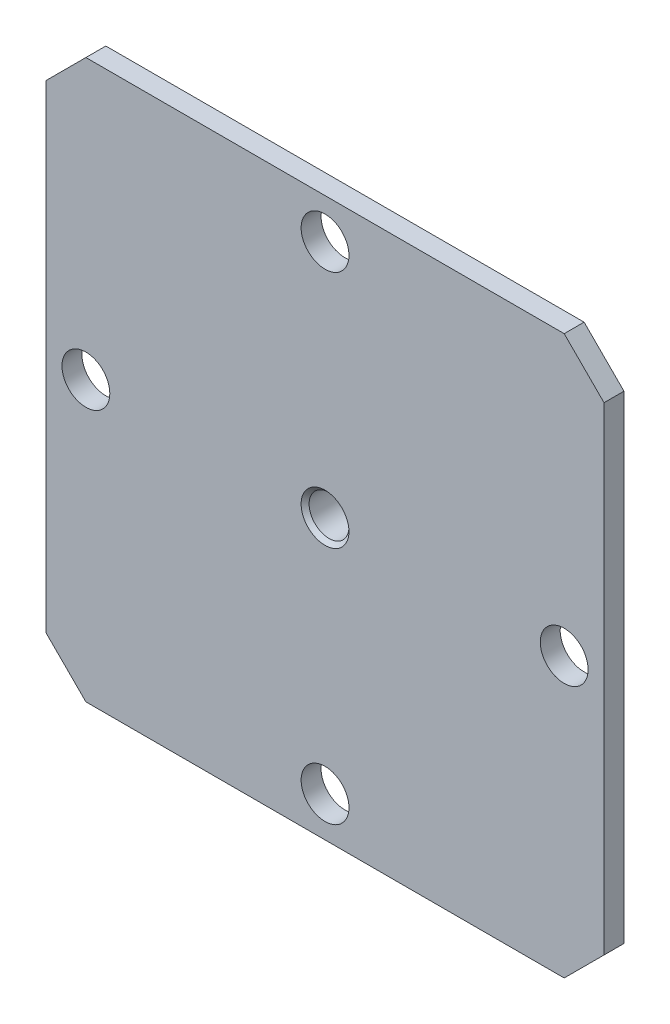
ISO-10303-21;
HEADER;
FILE_DESCRIPTION(('STEP AP214'),'2;1');
FILE_NAME('part.step','',(''),(''),'','','');
FILE_SCHEMA(('AUTOMOTIVE_DESIGN { 1 0 10303 214 1 1 1 1 }'));
ENDSEC;
DATA;
#1=APPLICATION_CONTEXT('core data for automotive mechanical design processes');
#2=APPLICATION_PROTOCOL_DEFINITION('international standard','automotive_design',2000,#1);
#3=PRODUCT_CONTEXT('',#1,'mechanical');
#4=PRODUCT('Part','Part','',(#3));
#5=PRODUCT_RELATED_PRODUCT_CATEGORY('part','',(#4));
#6=PRODUCT_DEFINITION_FORMATION('','',#4);
#7=PRODUCT_DEFINITION_CONTEXT('part definition',#1,'design');
#8=PRODUCT_DEFINITION('design','',#6,#7);
#9=PRODUCT_DEFINITION_SHAPE('','',#8);
#10=(LENGTH_UNIT() NAMED_UNIT(*) SI_UNIT(.MILLI.,.METRE.));
#11=(NAMED_UNIT(*) PLANE_ANGLE_UNIT() SI_UNIT($,.RADIAN.));
#12=(NAMED_UNIT(*) SI_UNIT($,.STERADIAN.) SOLID_ANGLE_UNIT());
#13=UNCERTAINTY_MEASURE_WITH_UNIT(LENGTH_MEASURE(1.E-05),#10,'distance_accuracy_value','');
#14=(GEOMETRIC_REPRESENTATION_CONTEXT(3) GLOBAL_UNCERTAINTY_ASSIGNED_CONTEXT((#13)) GLOBAL_UNIT_ASSIGNED_CONTEXT((#10,
#11,#12)) REPRESENTATION_CONTEXT('',''));
#15=CARTESIAN_POINT('',(0.,0.,0.));
#16=DIRECTION('',(0.,0.,1.));
#17=DIRECTION('',(1.,0.,0.));
#18=AXIS2_PLACEMENT_3D('',#15,#16,#17);
#19=CARTESIAN_POINT('',(-70.,70.,5.));
#20=DIRECTION('',(0.,-1.,0.));
#21=DIRECTION('',(1.,0.,0.));
#22=AXIS2_PLACEMENT_3D('',#19,#20,#21);
#23=PLANE('',#22);
#24=DIRECTION('',(-1.,0.,0.));
#25=VECTOR('',#24,1.);
#26=CARTESIAN_POINT('',(-70.,70.,0.));
#27=LINE('',#26,#25);
#28=CARTESIAN_POINT('',(60.0000000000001,70.,0.));
#29=VERTEX_POINT('',#28);
#30=CARTESIAN_POINT('',(-60.,70.,0.));
#31=VERTEX_POINT('',#30);
#32=EDGE_CURVE('E189',#29,#31,#27,.T.);
#33=ORIENTED_EDGE('',*,*,#32,.T.);
#34=DIRECTION('',(0.,0.,1.));
#35=VECTOR('',#34,1.);
#36=CARTESIAN_POINT('',(-60.,70.,5.));
#37=LINE('',#36,#35);
#38=CARTESIAN_POINT('',(-60.,70.,5.));
#39=VERTEX_POINT('',#38);
#40=EDGE_CURVE('E227',#31,#39,#37,.T.);
#41=ORIENTED_EDGE('',*,*,#40,.T.);
#42=DIRECTION('',(-1.,0.,0.));
#43=VECTOR('',#42,1.);
#44=CARTESIAN_POINT('',(-70.,70.,5.));
#45=LINE('',#44,#43);
#46=CARTESIAN_POINT('',(60.0000000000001,70.,5.));
#47=VERTEX_POINT('',#46);
#48=EDGE_CURVE('E190',#47,#39,#45,.T.);
#49=ORIENTED_EDGE('',*,*,#48,.F.);
#50=DIRECTION('',(0.,0.,-1.));
#51=VECTOR('',#50,1.);
#52=CARTESIAN_POINT('',(60.0000000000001,70.,5.));
#53=LINE('',#52,#51);
#54=EDGE_CURVE('E224',#47,#29,#53,.T.);
#55=ORIENTED_EDGE('',*,*,#54,.T.);
#56=EDGE_LOOP('',(#33,#41,#49,#55));
#57=FACE_BOUND('',#56,.T.);
#58=ADVANCED_FACE('F32',(#57),#23,.F.);
#59=CARTESIAN_POINT('',(-70.,-70.,5.));
#60=DIRECTION('',(1.,0.,0.));
#61=DIRECTION('',(0.,1.,0.));
#62=AXIS2_PLACEMENT_3D('',#59,#60,#61);
#63=PLANE('',#62);
#64=DIRECTION('',(0.,-1.,0.));
#65=VECTOR('',#64,1.);
#66=CARTESIAN_POINT('',(-70.,-70.,5.));
#67=LINE('',#66,#65);
#68=CARTESIAN_POINT('',(-70.0000000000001,60.,5.));
#69=VERTEX_POINT('',#68);
#70=CARTESIAN_POINT('',(-70.,-60.,5.));
#71=VERTEX_POINT('',#70);
#72=EDGE_CURVE('E193',#69,#71,#67,.T.);
#73=ORIENTED_EDGE('',*,*,#72,.F.);
#74=DIRECTION('',(0.,0.,-1.));
#75=VECTOR('',#74,1.);
#76=CARTESIAN_POINT('',(-70.,60.,5.));
#77=LINE('',#76,#75);
#78=CARTESIAN_POINT('',(-70.,60.,0.));
#79=VERTEX_POINT('',#78);
#80=EDGE_CURVE('E213',#69,#79,#77,.T.);
#81=ORIENTED_EDGE('',*,*,#80,.T.);
#82=DIRECTION('',(0.,-1.,0.));
#83=VECTOR('',#82,1.);
#84=CARTESIAN_POINT('',(-70.,-70.,0.));
#85=LINE('',#84,#83);
#86=CARTESIAN_POINT('',(-70.,-60.,0.));
#87=VERTEX_POINT('',#86);
#88=EDGE_CURVE('E205',#79,#87,#85,.T.);
#89=ORIENTED_EDGE('',*,*,#88,.T.);
#90=DIRECTION('',(0.,0.,1.));
#91=VECTOR('',#90,1.);
#92=CARTESIAN_POINT('',(-70.,-60.,5.));
#93=LINE('',#92,#91);
#94=EDGE_CURVE('E202',#87,#71,#93,.T.);
#95=ORIENTED_EDGE('',*,*,#94,.T.);
#96=EDGE_LOOP('',(#73,#81,#89,#95));
#97=FACE_BOUND('',#96,.T.);
#98=ADVANCED_FACE('F259',(#97),#63,.F.);
#99=CARTESIAN_POINT('',(-70.,-70.,5.));
#100=DIRECTION('',(0.,1.,0.));
#101=DIRECTION('',(-1.,0.,0.));
#102=AXIS2_PLACEMENT_3D('',#99,#100,#101);
#103=PLANE('',#102);
#104=DIRECTION('',(1.,0.,0.));
#105=VECTOR('',#104,1.);
#106=CARTESIAN_POINT('',(-70.,-70.,0.));
#107=LINE('',#106,#105);
#108=CARTESIAN_POINT('',(-60.,-70.,0.));
#109=VERTEX_POINT('',#108);
#110=CARTESIAN_POINT('',(60.,-70.,0.));
#111=VERTEX_POINT('',#110);
#112=EDGE_CURVE('E208',#109,#111,#107,.T.);
#113=ORIENTED_EDGE('',*,*,#112,.T.);
#114=DIRECTION('',(0.,0.,1.));
#115=VECTOR('',#114,1.);
#116=CARTESIAN_POINT('',(60.,-70.,5.));
#117=LINE('',#116,#115);
#118=CARTESIAN_POINT('',(60.,-70.,5.));
#119=VERTEX_POINT('',#118);
#120=EDGE_CURVE('E244',#111,#119,#117,.T.);
#121=ORIENTED_EDGE('',*,*,#120,.T.);
#122=DIRECTION('',(1.,0.,0.));
#123=VECTOR('',#122,1.);
#124=CARTESIAN_POINT('',(-70.,-70.,5.));
#125=LINE('',#124,#123);
#126=CARTESIAN_POINT('',(-60.,-70.,5.));
#127=VERTEX_POINT('',#126);
#128=EDGE_CURVE('E197',#127,#119,#125,.T.);
#129=ORIENTED_EDGE('',*,*,#128,.F.);
#130=DIRECTION('',(0.,0.,-1.));
#131=VECTOR('',#130,1.);
#132=CARTESIAN_POINT('',(-60.,-70.,5.));
#133=LINE('',#132,#131);
#134=EDGE_CURVE('E241',#127,#109,#133,.T.);
#135=ORIENTED_EDGE('',*,*,#134,.T.);
#136=EDGE_LOOP('',(#113,#121,#129,#135));
#137=FACE_BOUND('',#136,.T.);
#138=ADVANCED_FACE('F265',(#137),#103,.F.);
#139=CARTESIAN_POINT('',(70.,-70.,5.));
#140=DIRECTION('',(-1.,0.,0.));
#141=DIRECTION('',(0.,-1.,0.));
#142=AXIS2_PLACEMENT_3D('',#139,#140,#141);
#143=PLANE('',#142);
#144=DIRECTION('',(0.,1.,0.));
#145=VECTOR('',#144,1.);
#146=CARTESIAN_POINT('',(70.,-70.,0.));
#147=LINE('',#146,#145);
#148=CARTESIAN_POINT('',(70.,-60.,0.));
#149=VERTEX_POINT('',#148);
#150=CARTESIAN_POINT('',(70.,60.,0.));
#151=VERTEX_POINT('',#150);
#152=EDGE_CURVE('E194',#149,#151,#147,.T.);
#153=ORIENTED_EDGE('',*,*,#152,.T.);
#154=DIRECTION('',(0.,0.,1.));
#155=VECTOR('',#154,1.);
#156=CARTESIAN_POINT('',(70.,60.,5.));
#157=LINE('',#156,#155);
#158=CARTESIAN_POINT('',(70.,60.,5.));
#159=VERTEX_POINT('',#158);
#160=EDGE_CURVE('E55',#151,#159,#157,.T.);
#161=ORIENTED_EDGE('',*,*,#160,.T.);
#162=DIRECTION('',(0.,1.,0.));
#163=VECTOR('',#162,1.);
#164=CARTESIAN_POINT('',(70.,-70.,5.));
#165=LINE('',#164,#163);
#166=CARTESIAN_POINT('',(70.,-60.,5.));
#167=VERTEX_POINT('',#166);
#168=EDGE_CURVE('E200',#167,#159,#165,.T.);
#169=ORIENTED_EDGE('',*,*,#168,.F.);
#170=DIRECTION('',(0.,0.,-1.));
#171=VECTOR('',#170,1.);
#172=CARTESIAN_POINT('',(70.,-60.,5.));
#173=LINE('',#172,#171);
#174=EDGE_CURVE('E237',#167,#149,#173,.T.);
#175=ORIENTED_EDGE('',*,*,#174,.T.);
#176=EDGE_LOOP('',(#153,#161,#169,#175));
#177=FACE_BOUND('',#176,.T.);
#178=ADVANCED_FACE('F303',(#177),#143,.F.);
#179=CARTESIAN_POINT('',(70.,70.,5.));
#180=DIRECTION('',(0.,0.,1.));
#181=DIRECTION('',(1.,0.,0.));
#182=AXIS2_PLACEMENT_3D('',#179,#180,#181);
#183=PLANE('',#182);
#184=CARTESIAN_POINT('',(0.,0.,5.));
#185=DIRECTION('',(0.,0.,1.));
#186=DIRECTION('',(1.,0.,0.));
#187=AXIS2_PLACEMENT_3D('',#184,#185,#186);
#188=CIRCLE('',#187,5.99999999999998);
#189=CARTESIAN_POINT('',(5.99999999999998,0.,5.));
#190=VERTEX_POINT('',#189);
#191=EDGE_CURVE('E11',#190,#190,#188,.F.);
#192=ORIENTED_EDGE('',*,*,#191,.T.);
#193=EDGE_LOOP('',(#192));
#194=FACE_BOUND('',#193,.T.);
#195=CARTESIAN_POINT('',(-60.,0.,5.));
#196=DIRECTION('',(0.,0.,1.));
#197=DIRECTION('',(1.,0.,0.));
#198=AXIS2_PLACEMENT_3D('',#195,#196,#197);
#199=CIRCLE('',#198,5.99999999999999);
#200=CARTESIAN_POINT('',(-54.,0.,5.));
#201=VERTEX_POINT('',#200);
#202=EDGE_CURVE('E162',#201,#201,#199,.T.);
#203=ORIENTED_EDGE('',*,*,#202,.F.);
#204=EDGE_LOOP('',(#203));
#205=FACE_BOUND('',#204,.T.);
#206=CARTESIAN_POINT('',(0.,-60.,5.));
#207=DIRECTION('',(0.,0.,1.));
#208=DIRECTION('',(1.,0.,0.));
#209=AXIS2_PLACEMENT_3D('',#206,#207,#208);
#210=CIRCLE('',#209,6.);
#211=CARTESIAN_POINT('',(6.00000000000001,-60.,5.));
#212=VERTEX_POINT('',#211);
#213=EDGE_CURVE('E171',#212,#212,#210,.T.);
#214=ORIENTED_EDGE('',*,*,#213,.F.);
#215=EDGE_LOOP('',(#214));
#216=FACE_BOUND('',#215,.T.);
#217=CARTESIAN_POINT('',(60.,0.,5.));
#218=DIRECTION('',(0.,0.,1.));
#219=DIRECTION('',(1.,0.,0.));
#220=AXIS2_PLACEMENT_3D('',#217,#218,#219);
#221=CIRCLE('',#220,6.);
#222=CARTESIAN_POINT('',(66.,0.,5.));
#223=VERTEX_POINT('',#222);
#224=EDGE_CURVE('E177',#223,#223,#221,.T.);
#225=ORIENTED_EDGE('',*,*,#224,.F.);
#226=EDGE_LOOP('',(#225));
#227=FACE_BOUND('',#226,.T.);
#228=CARTESIAN_POINT('',(0.,60.,5.));
#229=DIRECTION('',(0.,0.,1.));
#230=DIRECTION('',(1.,0.,0.));
#231=AXIS2_PLACEMENT_3D('',#228,#229,#230);
#232=CIRCLE('',#231,6.);
#233=CARTESIAN_POINT('',(6.,60.,5.));
#234=VERTEX_POINT('',#233);
#235=EDGE_CURVE('E183',#234,#234,#232,.T.);
#236=ORIENTED_EDGE('',*,*,#235,.F.);
#237=EDGE_LOOP('',(#236));
#238=FACE_BOUND('',#237,.T.);
#239=ORIENTED_EDGE('',*,*,#48,.T.);
#240=DIRECTION('',(0.707106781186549,0.707106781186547,0.));
#241=VECTOR('',#240,1.);
#242=CARTESIAN_POINT('',(5.0000000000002,135.,5.));
#243=LINE('',#242,#241);
#244=EDGE_CURVE('E235',#39,#69,#243,.F.);
#245=ORIENTED_EDGE('',*,*,#244,.T.);
#246=ORIENTED_EDGE('',*,*,#72,.T.);
#247=DIRECTION('',(-0.707106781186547,0.707106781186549,0.));
#248=VECTOR('',#247,1.);
#249=CARTESIAN_POINT('',(-65.0000000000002,-64.9999999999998,5.));
#250=LINE('',#249,#248);
#251=EDGE_CURVE('E229',#71,#127,#250,.F.);
#252=ORIENTED_EDGE('',*,*,#251,.T.);
#253=ORIENTED_EDGE('',*,*,#128,.T.);
#254=DIRECTION('',(-0.707106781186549,-0.707106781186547,0.));
#255=VECTOR('',#254,1.);
#256=CARTESIAN_POINT('',(135.,4.9999999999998,5.));
#257=LINE('',#256,#255);
#258=EDGE_CURVE('E231',#119,#167,#257,.F.);
#259=ORIENTED_EDGE('',*,*,#258,.T.);
#260=ORIENTED_EDGE('',*,*,#168,.T.);
#261=DIRECTION('',(0.707106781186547,-0.707106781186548,0.));
#262=VECTOR('',#261,1.);
#263=CARTESIAN_POINT('',(65.,65.,5.));
#264=LINE('',#263,#262);
#265=EDGE_CURVE('E233',#159,#47,#264,.F.);
#266=ORIENTED_EDGE('',*,*,#265,.T.);
#267=EDGE_LOOP('',(#239,#245,#246,#252,#253,#259,#260,#266));
#268=FACE_BOUND('',#267,.T.);
#269=ADVANCED_FACE('F295',(#194,#205,#216,#227,#238,#268),#183,.T.);
#270=CARTESIAN_POINT('',(70.,70.,0.));
#271=DIRECTION('',(0.,0.,1.));
#272=DIRECTION('',(1.,0.,0.));
#273=AXIS2_PLACEMENT_3D('',#270,#271,#272);
#274=PLANE('',#273);
#275=DIRECTION('',(0.,1.,0.));
#276=VECTOR('',#275,1.);
#277=CARTESIAN_POINT('',(10.,70.,0.));
#278=LINE('',#277,#276);
#279=CARTESIAN_POINT('',(10.,-9.99999999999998,0.));
#280=VERTEX_POINT('',#279);
#281=CARTESIAN_POINT('',(10.,9.99999999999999,0.));
#282=VERTEX_POINT('',#281);
#283=EDGE_CURVE('E148',#280,#282,#278,.T.);
#284=ORIENTED_EDGE('',*,*,#283,.T.);
#285=DIRECTION('',(-1.,0.,0.));
#286=VECTOR('',#285,1.);
#287=CARTESIAN_POINT('',(70.,9.99999999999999,0.));
#288=LINE('',#287,#286);
#289=CARTESIAN_POINT('',(-10.,10.,0.));
#290=VERTEX_POINT('',#289);
#291=EDGE_CURVE('E157',#282,#290,#288,.T.);
#292=ORIENTED_EDGE('',*,*,#291,.T.);
#293=DIRECTION('',(0.,-1.,0.));
#294=VECTOR('',#293,1.);
#295=CARTESIAN_POINT('',(-10.,70.,0.));
#296=LINE('',#295,#294);
#297=CARTESIAN_POINT('',(-10.,-9.99999999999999,0.));
#298=VERTEX_POINT('',#297);
#299=EDGE_CURVE('E128',#290,#298,#296,.T.);
#300=ORIENTED_EDGE('',*,*,#299,.T.);
#301=DIRECTION('',(1.,0.,0.));
#302=VECTOR('',#301,1.);
#303=CARTESIAN_POINT('',(70.0000000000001,-9.99999999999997,0.));
#304=LINE('',#303,#302);
#305=EDGE_CURVE('E47',#298,#280,#304,.T.);
#306=ORIENTED_EDGE('',*,*,#305,.T.);
#307=EDGE_LOOP('',(#284,#292,#300,#306));
#308=FACE_BOUND('',#307,.T.);
#309=CARTESIAN_POINT('',(-60.,0.,0.));
#310=DIRECTION('',(0.,0.,1.));
#311=DIRECTION('',(1.,0.,0.));
#312=AXIS2_PLACEMENT_3D('',#309,#310,#311);
#313=CIRCLE('',#312,5.99999999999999);
#314=CARTESIAN_POINT('',(-54.,0.,0.));
#315=VERTEX_POINT('',#314);
#316=EDGE_CURVE('E168',#315,#315,#313,.F.);
#317=ORIENTED_EDGE('',*,*,#316,.F.);
#318=EDGE_LOOP('',(#317));
#319=FACE_BOUND('',#318,.T.);
#320=CARTESIAN_POINT('',(0.,-60.,0.));
#321=DIRECTION('',(0.,0.,1.));
#322=DIRECTION('',(1.,0.,0.));
#323=AXIS2_PLACEMENT_3D('',#320,#321,#322);
#324=CIRCLE('',#323,6.);
#325=CARTESIAN_POINT('',(6.00000000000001,-60.,0.));
#326=VERTEX_POINT('',#325);
#327=EDGE_CURVE('E174',#326,#326,#324,.F.);
#328=ORIENTED_EDGE('',*,*,#327,.F.);
#329=EDGE_LOOP('',(#328));
#330=FACE_BOUND('',#329,.T.);
#331=CARTESIAN_POINT('',(60.,0.,0.));
#332=DIRECTION('',(0.,0.,1.));
#333=DIRECTION('',(1.,0.,0.));
#334=AXIS2_PLACEMENT_3D('',#331,#332,#333);
#335=CIRCLE('',#334,6.);
#336=CARTESIAN_POINT('',(66.,0.,0.));
#337=VERTEX_POINT('',#336);
#338=EDGE_CURVE('E180',#337,#337,#335,.F.);
#339=ORIENTED_EDGE('',*,*,#338,.F.);
#340=EDGE_LOOP('',(#339));
#341=FACE_BOUND('',#340,.T.);
#342=CARTESIAN_POINT('',(0.,60.,0.));
#343=DIRECTION('',(0.,0.,1.));
#344=DIRECTION('',(1.,0.,0.));
#345=AXIS2_PLACEMENT_3D('',#342,#343,#344);
#346=CIRCLE('',#345,6.);
#347=CARTESIAN_POINT('',(6.,60.,0.));
#348=VERTEX_POINT('',#347);
#349=EDGE_CURVE('E186',#348,#348,#346,.F.);
#350=ORIENTED_EDGE('',*,*,#349,.F.);
#351=EDGE_LOOP('',(#350));
#352=FACE_BOUND('',#351,.T.);
#353=ORIENTED_EDGE('',*,*,#88,.F.);
#354=DIRECTION('',(-0.707106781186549,-0.707106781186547,0.));
#355=VECTOR('',#354,1.);
#356=CARTESIAN_POINT('',(-70.,60.,0.));
#357=LINE('',#356,#355);
#358=EDGE_CURVE('E222',#79,#31,#357,.F.);
#359=ORIENTED_EDGE('',*,*,#358,.T.);
#360=ORIENTED_EDGE('',*,*,#32,.F.);
#361=DIRECTION('',(-0.707106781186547,0.707106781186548,0.));
#362=VECTOR('',#361,1.);
#363=CARTESIAN_POINT('',(60.0000000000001,70.,0.));
#364=LINE('',#363,#362);
#365=EDGE_CURVE('E220',#29,#151,#364,.F.);
#366=ORIENTED_EDGE('',*,*,#365,.T.);
#367=ORIENTED_EDGE('',*,*,#152,.F.);
#368=DIRECTION('',(0.707106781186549,0.707106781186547,0.));
#369=VECTOR('',#368,1.);
#370=CARTESIAN_POINT('',(70.,-60.,0.));
#371=LINE('',#370,#369);
#372=EDGE_CURVE('E218',#149,#111,#371,.F.);
#373=ORIENTED_EDGE('',*,*,#372,.T.);
#374=ORIENTED_EDGE('',*,*,#112,.F.);
#375=DIRECTION('',(0.707106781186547,-0.707106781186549,0.));
#376=VECTOR('',#375,1.);
#377=CARTESIAN_POINT('',(-60.,-70.,0.));
#378=LINE('',#377,#376);
#379=EDGE_CURVE('E216',#109,#87,#378,.F.);
#380=ORIENTED_EDGE('',*,*,#379,.T.);
#381=EDGE_LOOP('',(#353,#359,#360,#366,#367,#373,#374,#380));
#382=FACE_BOUND('',#381,.T.);
#383=ADVANCED_FACE('F307',(#308,#319,#330,#341,#352,#382),#274,.F.);
#384=CARTESIAN_POINT('',(0.,60.,-0.00100000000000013));
#385=DIRECTION('',(0.,0.,1.));
#386=DIRECTION('',(1.,0.,0.));
#387=AXIS2_PLACEMENT_3D('',#384,#385,#386);
#388=CYLINDRICAL_SURFACE('',#387,6.);
#389=ORIENTED_EDGE('',*,*,#235,.T.);
#390=EDGE_LOOP('',(#389));
#391=FACE_BOUND('',#390,.T.);
#392=ORIENTED_EDGE('',*,*,#349,.T.);
#393=EDGE_LOOP('',(#392));
#394=FACE_BOUND('',#393,.T.);
#395=ADVANCED_FACE('F315',(#391,#394),#388,.F.);
#396=CARTESIAN_POINT('',(60.,0.,-0.00100000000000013));
#397=DIRECTION('',(0.,0.,1.));
#398=DIRECTION('',(1.,0.,0.));
#399=AXIS2_PLACEMENT_3D('',#396,#397,#398);
#400=CYLINDRICAL_SURFACE('',#399,6.);
#401=ORIENTED_EDGE('',*,*,#224,.T.);
#402=EDGE_LOOP('',(#401));
#403=FACE_BOUND('',#402,.T.);
#404=ORIENTED_EDGE('',*,*,#338,.T.);
#405=EDGE_LOOP('',(#404));
#406=FACE_BOUND('',#405,.T.);
#407=ADVANCED_FACE('F322',(#403,#406),#400,.F.);
#408=CARTESIAN_POINT('',(0.,-60.,-0.00100000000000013));
#409=DIRECTION('',(0.,0.,1.));
#410=DIRECTION('',(1.,0.,0.));
#411=AXIS2_PLACEMENT_3D('',#408,#409,#410);
#412=CYLINDRICAL_SURFACE('',#411,6.);
#413=ORIENTED_EDGE('',*,*,#213,.T.);
#414=EDGE_LOOP('',(#413));
#415=FACE_BOUND('',#414,.T.);
#416=ORIENTED_EDGE('',*,*,#327,.T.);
#417=EDGE_LOOP('',(#416));
#418=FACE_BOUND('',#417,.T.);
#419=ADVANCED_FACE('F422',(#415,#418),#412,.F.);
#420=CARTESIAN_POINT('',(-60.,0.,-0.00100000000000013));
#421=DIRECTION('',(0.,0.,1.));
#422=DIRECTION('',(1.,0.,0.));
#423=AXIS2_PLACEMENT_3D('',#420,#421,#422);
#424=CYLINDRICAL_SURFACE('',#423,5.99999999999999);
#425=ORIENTED_EDGE('',*,*,#202,.T.);
#426=EDGE_LOOP('',(#425));
#427=FACE_BOUND('',#426,.T.);
#428=ORIENTED_EDGE('',*,*,#316,.T.);
#429=EDGE_LOOP('',(#428));
#430=FACE_BOUND('',#429,.T.);
#431=ADVANCED_FACE('F274',(#427,#430),#424,.F.);
#432=CARTESIAN_POINT('',(-70.,60.,5.));
#433=DIRECTION('',(0.707106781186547,-0.707106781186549,0.));
#434=DIRECTION('',(0.707106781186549,0.707106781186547,0.));
#435=AXIS2_PLACEMENT_3D('',#432,#433,#434);
#436=PLANE('',#435);
#437=ORIENTED_EDGE('',*,*,#244,.F.);
#438=ORIENTED_EDGE('',*,*,#40,.F.);
#439=ORIENTED_EDGE('',*,*,#358,.F.);
#440=ORIENTED_EDGE('',*,*,#80,.F.);
#441=EDGE_LOOP('',(#437,#438,#439,#440));
#442=FACE_BOUND('',#441,.T.);
#443=ADVANCED_FACE('F270',(#442),#436,.F.);
#444=CARTESIAN_POINT('',(60.0000000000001,70.,5.));
#445=DIRECTION('',(-0.707106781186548,-0.707106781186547,0.));
#446=DIRECTION('',(0.707106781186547,-0.707106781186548,0.));
#447=AXIS2_PLACEMENT_3D('',#444,#445,#446);
#448=PLANE('',#447);
#449=ORIENTED_EDGE('',*,*,#265,.F.);
#450=ORIENTED_EDGE('',*,*,#160,.F.);
#451=ORIENTED_EDGE('',*,*,#365,.F.);
#452=ORIENTED_EDGE('',*,*,#54,.F.);
#453=EDGE_LOOP('',(#449,#450,#451,#452));
#454=FACE_BOUND('',#453,.T.);
#455=ADVANCED_FACE('F273',(#454),#448,.F.);
#456=CARTESIAN_POINT('',(70.,-60.,5.));
#457=DIRECTION('',(-0.707106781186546,0.707106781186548,0.));
#458=DIRECTION('',(-0.707106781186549,-0.707106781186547,0.));
#459=AXIS2_PLACEMENT_3D('',#456,#457,#458);
#460=PLANE('',#459);
#461=ORIENTED_EDGE('',*,*,#258,.F.);
#462=ORIENTED_EDGE('',*,*,#120,.F.);
#463=ORIENTED_EDGE('',*,*,#372,.F.);
#464=ORIENTED_EDGE('',*,*,#174,.F.);
#465=EDGE_LOOP('',(#461,#462,#463,#464));
#466=FACE_BOUND('',#465,.T.);
#467=ADVANCED_FACE('F278',(#466),#460,.F.);
#468=CARTESIAN_POINT('',(-60.,-70.,5.));
#469=DIRECTION('',(0.707106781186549,0.707106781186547,0.));
#470=DIRECTION('',(-0.707106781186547,0.707106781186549,0.));
#471=AXIS2_PLACEMENT_3D('',#468,#469,#470);
#472=PLANE('',#471);
#473=ORIENTED_EDGE('',*,*,#251,.F.);
#474=ORIENTED_EDGE('',*,*,#94,.F.);
#475=ORIENTED_EDGE('',*,*,#379,.F.);
#476=ORIENTED_EDGE('',*,*,#134,.F.);
#477=EDGE_LOOP('',(#473,#474,#475,#476));
#478=FACE_BOUND('',#477,.T.);
#479=ADVANCED_FACE('F281',(#478),#472,.F.);
#480=CARTESIAN_POINT('',(70.,9.99999999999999,-7.));
#481=DIRECTION('',(0.,1.,0.));
#482=DIRECTION('',(-1.,0.,0.));
#483=AXIS2_PLACEMENT_3D('',#480,#481,#482);
#484=PLANE('',#483);
#485=ORIENTED_EDGE('',*,*,#291,.F.);
#486=DIRECTION('',(0.,0.,1.));
#487=VECTOR('',#486,1.);
#488=CARTESIAN_POINT('',(10.,9.99999999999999,-7.));
#489=LINE('',#488,#487);
#490=CARTESIAN_POINT('',(10.,9.99999999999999,-7.));
#491=VERTEX_POINT('',#490);
#492=EDGE_CURVE('E147',#491,#282,#489,.T.);
#493=ORIENTED_EDGE('',*,*,#492,.F.);
#494=DIRECTION('',(-1.,0.,0.));
#495=VECTOR('',#494,1.);
#496=CARTESIAN_POINT('',(70.,9.99999999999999,-7.));
#497=LINE('',#496,#495);
#498=CARTESIAN_POINT('',(-10.,10.,-7.));
#499=VERTEX_POINT('',#498);
#500=EDGE_CURVE('E141',#491,#499,#497,.T.);
#501=ORIENTED_EDGE('',*,*,#500,.T.);
#502=DIRECTION('',(0.,0.,1.));
#503=VECTOR('',#502,1.);
#504=CARTESIAN_POINT('',(-10.,10.,-7.));
#505=LINE('',#504,#503);
#506=EDGE_CURVE('E123',#499,#290,#505,.T.);
#507=ORIENTED_EDGE('',*,*,#506,.T.);
#508=EDGE_LOOP('',(#485,#493,#501,#507));
#509=FACE_BOUND('',#508,.T.);
#510=ADVANCED_FACE('F146',(#509),#484,.T.);
#511=CARTESIAN_POINT('',(10.,70.,-7.));
#512=DIRECTION('',(1.,0.,0.));
#513=DIRECTION('',(0.,1.,0.));
#514=AXIS2_PLACEMENT_3D('',#511,#512,#513);
#515=PLANE('',#514);
#516=ORIENTED_EDGE('',*,*,#283,.F.);
#517=DIRECTION('',(0.,0.,1.));
#518=VECTOR('',#517,1.);
#519=CARTESIAN_POINT('',(10.,-9.99999999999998,-7.));
#520=LINE('',#519,#518);
#521=CARTESIAN_POINT('',(10.,-9.99999999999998,-7.));
#522=VERTEX_POINT('',#521);
#523=EDGE_CURVE('E163',#522,#280,#520,.T.);
#524=ORIENTED_EDGE('',*,*,#523,.F.);
#525=DIRECTION('',(0.,1.,0.));
#526=VECTOR('',#525,1.);
#527=CARTESIAN_POINT('',(10.,70.,-7.));
#528=LINE('',#527,#526);
#529=EDGE_CURVE('E134',#522,#491,#528,.T.);
#530=ORIENTED_EDGE('',*,*,#529,.T.);
#531=ORIENTED_EDGE('',*,*,#492,.T.);
#532=EDGE_LOOP('',(#516,#524,#530,#531));
#533=FACE_BOUND('',#532,.T.);
#534=ADVANCED_FACE('F288',(#533),#515,.T.);
#535=CARTESIAN_POINT('',(70.0000000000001,-9.99999999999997,-7.));
#536=DIRECTION('',(0.,-1.,0.));
#537=DIRECTION('',(1.,0.,0.));
#538=AXIS2_PLACEMENT_3D('',#535,#536,#537);
#539=PLANE('',#538);
#540=ORIENTED_EDGE('',*,*,#305,.F.);
#541=DIRECTION('',(0.,0.,1.));
#542=VECTOR('',#541,1.);
#543=CARTESIAN_POINT('',(-10.,-9.99999999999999,-7.));
#544=LINE('',#543,#542);
#545=CARTESIAN_POINT('',(-10.,-9.99999999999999,-7.));
#546=VERTEX_POINT('',#545);
#547=EDGE_CURVE('E133',#546,#298,#544,.T.);
#548=ORIENTED_EDGE('',*,*,#547,.F.);
#549=DIRECTION('',(1.,0.,0.));
#550=VECTOR('',#549,1.);
#551=CARTESIAN_POINT('',(70.0000000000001,-9.99999999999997,-7.));
#552=LINE('',#551,#550);
#553=EDGE_CURVE('E144',#546,#522,#552,.T.);
#554=ORIENTED_EDGE('',*,*,#553,.T.);
#555=ORIENTED_EDGE('',*,*,#523,.T.);
#556=EDGE_LOOP('',(#540,#548,#554,#555));
#557=FACE_BOUND('',#556,.T.);
#558=ADVANCED_FACE('F370',(#557),#539,.T.);
#559=CARTESIAN_POINT('',(-10.,70.,-7.));
#560=DIRECTION('',(-1.,0.,0.));
#561=DIRECTION('',(0.,-1.,0.));
#562=AXIS2_PLACEMENT_3D('',#559,#560,#561);
#563=PLANE('',#562);
#564=ORIENTED_EDGE('',*,*,#299,.F.);
#565=ORIENTED_EDGE('',*,*,#506,.F.);
#566=DIRECTION('',(0.,-1.,0.));
#567=VECTOR('',#566,1.);
#568=CARTESIAN_POINT('',(-10.,70.,-7.));
#569=LINE('',#568,#567);
#570=EDGE_CURVE('E126',#499,#546,#569,.T.);
#571=ORIENTED_EDGE('',*,*,#570,.T.);
#572=ORIENTED_EDGE('',*,*,#547,.T.);
#573=EDGE_LOOP('',(#564,#565,#571,#572));
#574=FACE_BOUND('',#573,.T.);
#575=ADVANCED_FACE('F125',(#574),#563,.T.);
#576=CARTESIAN_POINT('',(10.,9.99999999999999,-7.));
#577=DIRECTION('',(0.,0.,-1.));
#578=DIRECTION('',(-1.,0.,0.));
#579=AXIS2_PLACEMENT_3D('',#576,#577,#578);
#580=PLANE('',#579);
#581=CARTESIAN_POINT('',(0.,0.,-7.));
#582=DIRECTION('',(0.,0.,-1.));
#583=DIRECTION('',(-1.,0.,0.));
#584=AXIS2_PLACEMENT_3D('',#581,#582,#583);
#585=CIRCLE('',#584,5.);
#586=CARTESIAN_POINT('',(-5.,0.,-7.));
#587=VERTEX_POINT('',#586);
#588=EDGE_CURVE('E153',#587,#587,#585,.F.);
#589=ORIENTED_EDGE('',*,*,#588,.T.);
#590=EDGE_LOOP('',(#589));
#591=FACE_BOUND('',#590,.T.);
#592=ORIENTED_EDGE('',*,*,#500,.F.);
#593=ORIENTED_EDGE('',*,*,#529,.F.);
#594=ORIENTED_EDGE('',*,*,#553,.F.);
#595=ORIENTED_EDGE('',*,*,#570,.F.);
#596=EDGE_LOOP('',(#592,#593,#594,#595));
#597=FACE_BOUND('',#596,.T.);
#598=ADVANCED_FACE('F139',(#591,#597),#580,.T.);
#599=CARTESIAN_POINT('',(0.,0.,-7.001));
#600=DIRECTION('',(0.,0.,1.));
#601=DIRECTION('',(1.,0.,0.));
#602=AXIS2_PLACEMENT_3D('',#599,#600,#601);
#603=CYLINDRICAL_SURFACE('',#602,5.);
#604=CARTESIAN_POINT('',(0.,0.,4.00000000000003));
#605=DIRECTION('',(0.,0.,1.));
#606=DIRECTION('',(1.,0.,0.));
#607=AXIS2_PLACEMENT_3D('',#604,#605,#606);
#608=CIRCLE('',#607,5.);
#609=CARTESIAN_POINT('',(5.,0.,4.00000000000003));
#610=VERTEX_POINT('',#609);
#611=EDGE_CURVE('E40',#610,#610,#608,.T.);
#612=ORIENTED_EDGE('',*,*,#611,.T.);
#613=EDGE_LOOP('',(#612));
#614=FACE_BOUND('',#613,.T.);
#615=ORIENTED_EDGE('',*,*,#588,.F.);
#616=EDGE_LOOP('',(#615));
#617=FACE_BOUND('',#616,.T.);
#618=ADVANCED_FACE('F248',(#614,#617),#603,.F.);
#619=CARTESIAN_POINT('',(0.,0.,4.00000000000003));
#620=DIRECTION('',(0.,0.,1.));
#621=DIRECTION('',(1.,0.,0.));
#622=AXIS2_PLACEMENT_3D('',#619,#620,#621);
#623=CONICAL_SURFACE('',#622,5.,0.785398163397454);
#624=ORIENTED_EDGE('',*,*,#191,.F.);
#625=EDGE_LOOP('',(#624));
#626=FACE_BOUND('',#625,.T.);
#627=ORIENTED_EDGE('',*,*,#611,.F.);
#628=EDGE_LOOP('',(#627));
#629=FACE_BOUND('',#628,.T.);
#630=ADVANCED_FACE('F34',(#626,#629),#623,.F.);
#631=CLOSED_SHELL('',(#58,#98,#138,#178,#269,#383,#395,#407,#419,#431,#443,#455,#467,#479,#510,
#534,#558,#575,#598,#618,#630));
#632=MANIFOLD_SOLID_BREP('B2',#631);
#633=ADVANCED_BREP_SHAPE_REPRESENTATION('',(#18,#632),#14);
#634=SHAPE_DEFINITION_REPRESENTATION(#9,#633);
ENDSEC;
END-ISO-10303-21;
